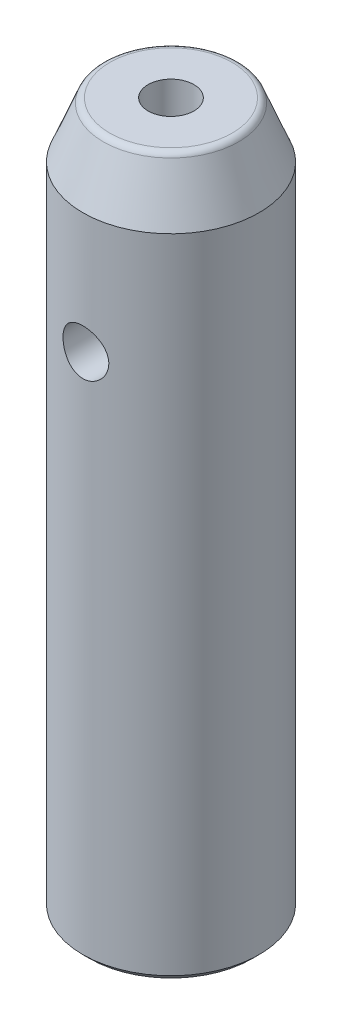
from build123d import *

# Parameters (mm, degrees)
SKETCH_1_R          = 6.35
EXTRUDE_1_DEPTH     = 50.8
M4X0_7_1_D          = 3.3
M4X0_7_1_DEPTH      = 10.1
M4X0_7_1_TIP        = 0.991420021
M6X1_0_1_D          = 5
M6X1_0_1_DEPTH      = 11
M6X1_0_1_TIP        = 1.502151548
CHAMFER_1_SIZE      = 4
CHAMFER_1_SIZE2     = 1.6
FILLET_1_R          = 0.5
CHAMFER_2_SIZE      = 0.5
SKETCH_6_R          = 1.65
CUT_EXTRUDE_1_DEPTH = 53.74706153


with BuildPart() as part:
    # Sketch 1 → Extrude 1 (new body)
    with BuildSketch(Plane(origin=(0, 0, 0), x_dir=(1, 0, 0), z_dir=(0, 1, 0))):
        with Locations(Location((0, 0, 0), (0, 0, 270))):
            Circle(SKETCH_1_R)
    extrude(amount=EXTRUDE_1_DEPTH)

    # M4x0.7 _1
    with Locations(Plane(origin=(0, 50.8, 0), x_dir=(1, 0, 0), z_dir=(0, 1, 0))):
        with Locations((0, 0)):
            Hole(M4X0_7_1_D / 2, depth=M4X0_7_1_DEPTH)
            with Locations((0, 0, -(M4X0_7_1_DEPTH + M4X0_7_1_TIP / 2))):  # 118° drill point
                Cone(0, M4X0_7_1_D / 2, M4X0_7_1_TIP, mode=Mode.SUBTRACT)

    # M6x1.0 _1
    with Locations(Plane(origin=(0, 0, 0), x_dir=(-1, 0, 0), z_dir=(0, -1, 0))):
        with Locations((0, 0)):
            Hole(M6X1_0_1_D / 2, depth=M6X1_0_1_DEPTH)
            with Locations((0, 0, -(M6X1_0_1_DEPTH + M6X1_0_1_TIP / 2))):  # 118° drill point
                Cone(0, M6X1_0_1_D / 2, M6X1_0_1_TIP, mode=Mode.SUBTRACT)

    # Chamfer 1
    chamfer_1_edges = [part.edges().sort_by_distance(p)[0] for p in [
        (0, 50.8, -6.35),
    ]]
    chamfer_1_side = [part.faces().sort_by_distance(p)[0] for p in [
        (0, 25.4, -6.35),
    ]]
    chamfer(chamfer_1_edges, length=CHAMFER_1_SIZE, length2=CHAMFER_1_SIZE2, reference=chamfer_1_side[0])

    # Fillet 1
    fillet_1_edges = [part.edges().sort_by_distance(p)[0] for p in [
        (0, 50.8, -4.75),
    ]]
    fillet(fillet_1_edges, radius=FILLET_1_R)

    # Chamfer 2
    chamfer_2_edges = [part.edges().sort_by_distance(p)[0] for p in [
        (0, 0, -6.35),
    ]]
    chamfer(chamfer_2_edges, length=CHAMFER_2_SIZE)

    # Sketch 6 → Cut-Extrude 1 (cut, through all)
    with BuildSketch(Plane.XY.offset(6.35)):
        with Locations(Location((0, 38.1, 0), (0, 0, 89.999999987))):
            Circle(SKETCH_6_R)
    extrude(amount=-CUT_EXTRUDE_1_DEPTH, mode=Mode.SUBTRACT)


solid = part.part
